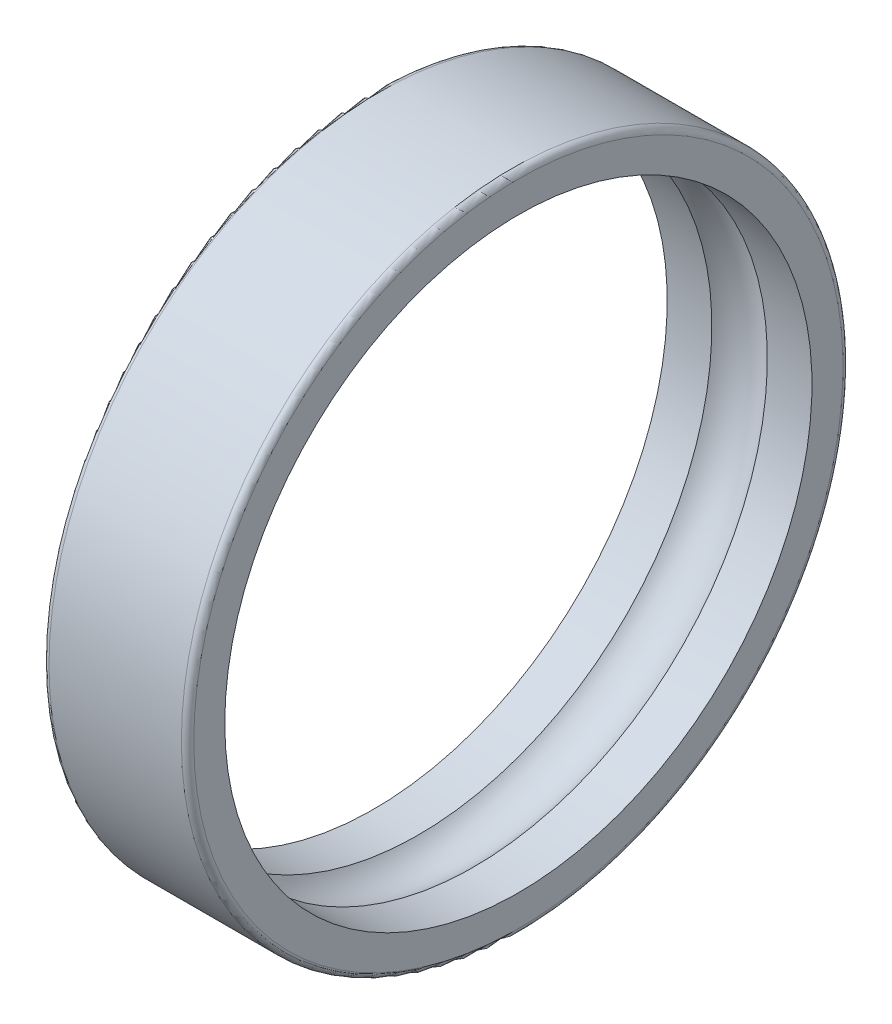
ISO-10303-21;
HEADER;
FILE_DESCRIPTION(('STEP AP214'),'2;1');
FILE_NAME('part.step','',(''),(''),'','','');
FILE_SCHEMA(('AUTOMOTIVE_DESIGN { 1 0 10303 214 1 1 1 1 }'));
ENDSEC;
DATA;
#1=APPLICATION_CONTEXT('core data for automotive mechanical design processes');
#2=APPLICATION_PROTOCOL_DEFINITION('international standard','automotive_design',2000,#1);
#3=PRODUCT_CONTEXT('',#1,'mechanical');
#4=PRODUCT('Part','Part','',(#3));
#5=PRODUCT_RELATED_PRODUCT_CATEGORY('part','',(#4));
#6=PRODUCT_DEFINITION_FORMATION('','',#4);
#7=PRODUCT_DEFINITION_CONTEXT('part definition',#1,'design');
#8=PRODUCT_DEFINITION('design','',#6,#7);
#9=PRODUCT_DEFINITION_SHAPE('','',#8);
#10=(LENGTH_UNIT() NAMED_UNIT(*) SI_UNIT(.MILLI.,.METRE.));
#11=(NAMED_UNIT(*) PLANE_ANGLE_UNIT() SI_UNIT($,.RADIAN.));
#12=(NAMED_UNIT(*) SI_UNIT($,.STERADIAN.) SOLID_ANGLE_UNIT());
#13=UNCERTAINTY_MEASURE_WITH_UNIT(LENGTH_MEASURE(1.E-05),#10,'distance_accuracy_value','');
#14=(GEOMETRIC_REPRESENTATION_CONTEXT(3) GLOBAL_UNCERTAINTY_ASSIGNED_CONTEXT((#13)) GLOBAL_UNIT_ASSIGNED_CONTEXT((#10,
#11,#12)) REPRESENTATION_CONTEXT('',''));
#15=CARTESIAN_POINT('',(0.,0.,0.));
#16=DIRECTION('',(0.,0.,1.));
#17=DIRECTION('',(1.,0.,0.));
#18=AXIS2_PLACEMENT_3D('',#15,#16,#17);
#19=CARTESIAN_POINT('',(0.299999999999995,0.,0.));
#20=DIRECTION('',(-1.,0.,0.));
#21=DIRECTION('',(0.,0.,1.));
#22=AXIS2_PLACEMENT_3D('',#19,#20,#21);
#23=TOROIDAL_SURFACE('',#22,15.7,0.300000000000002);
#24=CARTESIAN_POINT('',(0.,0.,0.));
#25=DIRECTION('',(-1.,0.,0.));
#26=DIRECTION('',(0.,0.,1.));
#27=AXIS2_PLACEMENT_3D('',#24,#25,#26);
#28=CIRCLE('',#27,15.7);
#29=CARTESIAN_POINT('',(0.,0.,15.7000000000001));
#30=VERTEX_POINT('',#29);
#31=EDGE_CURVE('E10',#30,#30,#28,.T.);
#32=ORIENTED_EDGE('',*,*,#31,.F.);
#33=EDGE_LOOP('',(#32));
#34=FACE_BOUND('',#33,.T.);
#35=CARTESIAN_POINT('',(0.299999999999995,0.,0.));
#36=DIRECTION('',(-1.,0.,0.));
#37=DIRECTION('',(0.,0.,1.));
#38=AXIS2_PLACEMENT_3D('',#35,#36,#37);
#39=CIRCLE('',#38,16.);
#40=CARTESIAN_POINT('',(0.299999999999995,0.,16.0000000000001));
#41=VERTEX_POINT('',#40);
#42=EDGE_CURVE('E56',#41,#41,#39,.T.);
#43=ORIENTED_EDGE('',*,*,#42,.T.);
#44=EDGE_LOOP('',(#43));
#45=FACE_BOUND('',#44,.T.);
#46=ADVANCED_FACE('F28',(#34,#45),#23,.T.);
#47=CARTESIAN_POINT('',(0.,0.,-15.7000000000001));
#48=DIRECTION('',(1.,0.,0.));
#49=DIRECTION('',(0.,0.,-1.));
#50=AXIS2_PLACEMENT_3D('',#47,#48,#49);
#51=PLANE('',#50);
#52=CARTESIAN_POINT('',(0.,0.,0.));
#53=DIRECTION('',(-1.,0.,0.));
#54=DIRECTION('',(0.,0.,1.));
#55=AXIS2_PLACEMENT_3D('',#52,#53,#54);
#56=CIRCLE('',#55,14.2);
#57=CARTESIAN_POINT('',(0.,0.,14.2));
#58=VERTEX_POINT('',#57);
#59=EDGE_CURVE('E34',#58,#58,#56,.T.);
#60=ORIENTED_EDGE('',*,*,#59,.F.);
#61=EDGE_LOOP('',(#60));
#62=FACE_BOUND('',#61,.T.);
#63=ORIENTED_EDGE('',*,*,#31,.T.);
#64=EDGE_LOOP('',(#63));
#65=FACE_BOUND('',#64,.T.);
#66=ADVANCED_FACE('F93',(#62,#65),#51,.F.);
#67=CARTESIAN_POINT('',(0.,0.,0.));
#68=DIRECTION('',(-1.,0.,0.));
#69=DIRECTION('',(0.,0.,1.));
#70=AXIS2_PLACEMENT_3D('',#67,#68,#69);
#71=CYLINDRICAL_SURFACE('',#70,14.2);
#72=CARTESIAN_POINT('',(2.15835921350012,0.,1.11022302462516E-13));
#73=DIRECTION('',(-1.,0.,0.));
#74=DIRECTION('',(0.,0.,1.));
#75=AXIS2_PLACEMENT_3D('',#72,#73,#74);
#76=CIRCLE('',#75,14.2);
#77=CARTESIAN_POINT('',(2.15835921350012,0.,14.2000000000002));
#78=VERTEX_POINT('',#77);
#79=EDGE_CURVE('E38',#78,#78,#76,.T.);
#80=ORIENTED_EDGE('',*,*,#79,.F.);
#81=EDGE_LOOP('',(#80));
#82=FACE_BOUND('',#81,.T.);
#83=ORIENTED_EDGE('',*,*,#59,.T.);
#84=EDGE_LOOP('',(#83));
#85=FACE_BOUND('',#84,.T.);
#86=ADVANCED_FACE('F88',(#82,#85),#71,.F.);
#87=CARTESIAN_POINT('',(3.5,0.,0.));
#88=DIRECTION('',(-1.,0.,0.));
#89=DIRECTION('',(0.,0.,1.));
#90=AXIS2_PLACEMENT_3D('',#87,#88,#89);
#91=TOROIDAL_SURFACE('',#90,13.,1.8);
#92=CARTESIAN_POINT('',(4.84164078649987,0.,0.));
#93=DIRECTION('',(-1.,0.,0.));
#94=DIRECTION('',(0.,0.,1.));
#95=AXIS2_PLACEMENT_3D('',#92,#93,#94);
#96=CIRCLE('',#95,14.2);
#97=CARTESIAN_POINT('',(4.84164078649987,0.,14.2));
#98=VERTEX_POINT('',#97);
#99=EDGE_CURVE('E42',#98,#98,#96,.T.);
#100=ORIENTED_EDGE('',*,*,#99,.F.);
#101=EDGE_LOOP('',(#100));
#102=FACE_BOUND('',#101,.T.);
#103=ORIENTED_EDGE('',*,*,#79,.T.);
#104=EDGE_LOOP('',(#103));
#105=FACE_BOUND('',#104,.T.);
#106=ADVANCED_FACE('F82',(#102,#105),#91,.F.);
#107=CARTESIAN_POINT('',(0.,0.,0.));
#108=DIRECTION('',(-1.,0.,0.));
#109=DIRECTION('',(0.,0.,1.));
#110=AXIS2_PLACEMENT_3D('',#107,#108,#109);
#111=CYLINDRICAL_SURFACE('',#110,14.2);
#112=CARTESIAN_POINT('',(7.00000000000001,0.,1.11022302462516E-13));
#113=DIRECTION('',(-1.,0.,0.));
#114=DIRECTION('',(0.,0.,1.));
#115=AXIS2_PLACEMENT_3D('',#112,#113,#114);
#116=CIRCLE('',#115,14.2);
#117=CARTESIAN_POINT('',(7.00000000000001,0.,14.2000000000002));
#118=VERTEX_POINT('',#117);
#119=EDGE_CURVE('E47',#118,#118,#116,.T.);
#120=ORIENTED_EDGE('',*,*,#119,.F.);
#121=EDGE_LOOP('',(#120));
#122=FACE_BOUND('',#121,.T.);
#123=ORIENTED_EDGE('',*,*,#99,.T.);
#124=EDGE_LOOP('',(#123));
#125=FACE_BOUND('',#124,.T.);
#126=ADVANCED_FACE('F76',(#122,#125),#111,.F.);
#127=CARTESIAN_POINT('',(7.00000000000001,0.,-15.7));
#128=DIRECTION('',(-1.,0.,0.));
#129=DIRECTION('',(0.,0.,1.));
#130=AXIS2_PLACEMENT_3D('',#127,#128,#129);
#131=PLANE('',#130);
#132=CARTESIAN_POINT('',(7.00000000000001,0.,1.11022302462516E-13));
#133=DIRECTION('',(-1.,0.,0.));
#134=DIRECTION('',(0.,0.,1.));
#135=AXIS2_PLACEMENT_3D('',#132,#133,#134);
#136=CIRCLE('',#135,15.7);
#137=CARTESIAN_POINT('',(7.00000000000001,0.,15.7000000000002));
#138=VERTEX_POINT('',#137);
#139=EDGE_CURVE('E50',#138,#138,#136,.T.);
#140=ORIENTED_EDGE('',*,*,#139,.F.);
#141=EDGE_LOOP('',(#140));
#142=FACE_BOUND('',#141,.T.);
#143=ORIENTED_EDGE('',*,*,#119,.T.);
#144=EDGE_LOOP('',(#143));
#145=FACE_BOUND('',#144,.T.);
#146=ADVANCED_FACE('F70',(#142,#145),#131,.F.);
#147=CARTESIAN_POINT('',(6.7,0.,1.11022302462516E-13));
#148=DIRECTION('',(-1.,0.,0.));
#149=DIRECTION('',(0.,0.,1.));
#150=AXIS2_PLACEMENT_3D('',#147,#148,#149);
#151=TOROIDAL_SURFACE('',#150,15.7,0.300000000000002);
#152=CARTESIAN_POINT('',(6.7,0.,1.11022302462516E-13));
#153=DIRECTION('',(-1.,0.,0.));
#154=DIRECTION('',(0.,0.,1.));
#155=AXIS2_PLACEMENT_3D('',#152,#153,#154);
#156=CIRCLE('',#155,16.);
#157=CARTESIAN_POINT('',(6.7,0.,16.0000000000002));
#158=VERTEX_POINT('',#157);
#159=EDGE_CURVE('E53',#158,#158,#156,.T.);
#160=ORIENTED_EDGE('',*,*,#159,.F.);
#161=EDGE_LOOP('',(#160));
#162=FACE_BOUND('',#161,.T.);
#163=ORIENTED_EDGE('',*,*,#139,.T.);
#164=EDGE_LOOP('',(#163));
#165=FACE_BOUND('',#164,.T.);
#166=ADVANCED_FACE('F64',(#162,#165),#151,.T.);
#167=CARTESIAN_POINT('',(0.,0.,0.));
#168=DIRECTION('',(-1.,0.,0.));
#169=DIRECTION('',(0.,0.,1.));
#170=AXIS2_PLACEMENT_3D('',#167,#168,#169);
#171=CYLINDRICAL_SURFACE('',#170,16.);
#172=ORIENTED_EDGE('',*,*,#42,.F.);
#173=EDGE_LOOP('',(#172));
#174=FACE_BOUND('',#173,.T.);
#175=ORIENTED_EDGE('',*,*,#159,.T.);
#176=EDGE_LOOP('',(#175));
#177=FACE_BOUND('',#176,.T.);
#178=ADVANCED_FACE('F61',(#174,#177),#171,.T.);
#179=CLOSED_SHELL('',(#46,#66,#86,#106,#126,#146,#166,#178));
#180=MANIFOLD_SOLID_BREP('B2',#179);
#181=ADVANCED_BREP_SHAPE_REPRESENTATION('',(#18,#180),#14);
#182=SHAPE_DEFINITION_REPRESENTATION(#9,#181);
ENDSEC;
END-ISO-10303-21;
